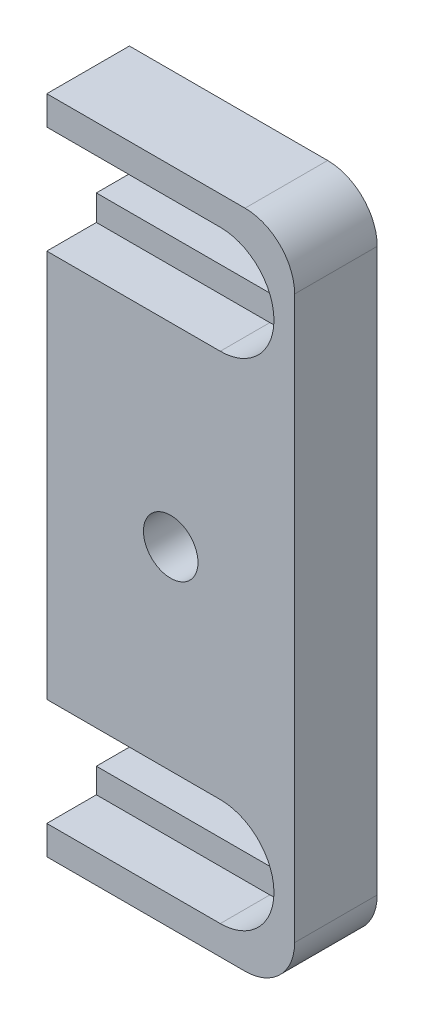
ISO-10303-21;
HEADER;
FILE_DESCRIPTION(('STEP AP214'),'2;1');
FILE_NAME('part.step','',(''),(''),'','','');
FILE_SCHEMA(('AUTOMOTIVE_DESIGN { 1 0 10303 214 1 1 1 1 }'));
ENDSEC;
DATA;
#1=APPLICATION_CONTEXT('core data for automotive mechanical design processes');
#2=APPLICATION_PROTOCOL_DEFINITION('international standard','automotive_design',2000,#1);
#3=PRODUCT_CONTEXT('',#1,'mechanical');
#4=PRODUCT('Part','Part','',(#3));
#5=PRODUCT_RELATED_PRODUCT_CATEGORY('part','',(#4));
#6=PRODUCT_DEFINITION_FORMATION('','',#4);
#7=PRODUCT_DEFINITION_CONTEXT('part definition',#1,'design');
#8=PRODUCT_DEFINITION('design','',#6,#7);
#9=PRODUCT_DEFINITION_SHAPE('','',#8);
#10=(LENGTH_UNIT() NAMED_UNIT(*) SI_UNIT(.MILLI.,.METRE.));
#11=(NAMED_UNIT(*) PLANE_ANGLE_UNIT() SI_UNIT($,.RADIAN.));
#12=(NAMED_UNIT(*) SI_UNIT($,.STERADIAN.) SOLID_ANGLE_UNIT());
#13=UNCERTAINTY_MEASURE_WITH_UNIT(LENGTH_MEASURE(1.E-05),#10,'distance_accuracy_value','');
#14=(GEOMETRIC_REPRESENTATION_CONTEXT(3) GLOBAL_UNCERTAINTY_ASSIGNED_CONTEXT((#13)) GLOBAL_UNIT_ASSIGNED_CONTEXT((#10,
#11,#12)) REPRESENTATION_CONTEXT('',''));
#15=CARTESIAN_POINT('',(0.,0.,0.));
#16=DIRECTION('',(0.,0.,1.));
#17=DIRECTION('',(1.,0.,0.));
#18=AXIS2_PLACEMENT_3D('',#15,#16,#17);
#19=CARTESIAN_POINT('',(0.,0.,0.));
#20=DIRECTION('',(-1.,0.,0.));
#21=DIRECTION('',(0.,-1.,0.));
#22=AXIS2_PLACEMENT_3D('',#19,#20,#21);
#23=PLANE('',#22);
#24=DIRECTION('',(0.,0.,-1.));
#25=VECTOR('',#24,1.);
#26=CARTESIAN_POINT('',(0.,-36.7500000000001,5.));
#27=LINE('',#26,#25);
#28=CARTESIAN_POINT('',(0.,-36.7500000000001,2.));
#29=VERTEX_POINT('',#28);
#30=CARTESIAN_POINT('',(0.,-36.7500000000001,0.));
#31=VERTEX_POINT('',#30);
#32=EDGE_CURVE('E184',#29,#31,#27,.T.);
#33=ORIENTED_EDGE('',*,*,#32,.T.);
#34=DIRECTION('',(0.,-1.,0.));
#35=VECTOR('',#34,1.);
#36=CARTESIAN_POINT('',(0.,0.,0.));
#37=LINE('',#36,#35);
#38=CARTESIAN_POINT('',(0.,-40.,0.));
#39=VERTEX_POINT('',#38);
#40=EDGE_CURVE('E197',#31,#39,#37,.T.);
#41=ORIENTED_EDGE('',*,*,#40,.T.);
#42=DIRECTION('',(0.,0.,1.));
#43=VECTOR('',#42,1.);
#44=CARTESIAN_POINT('',(0.,-40.,0.));
#45=LINE('',#44,#43);
#46=CARTESIAN_POINT('',(0.,-40.,5.));
#47=VERTEX_POINT('',#46);
#48=EDGE_CURVE('E226',#39,#47,#45,.T.);
#49=ORIENTED_EDGE('',*,*,#48,.T.);
#50=DIRECTION('',(0.,-1.,0.));
#51=VECTOR('',#50,1.);
#52=CARTESIAN_POINT('',(0.,0.,5.));
#53=LINE('',#52,#51);
#54=CARTESIAN_POINT('',(0.,-38.25,5.));
#55=VERTEX_POINT('',#54);
#56=EDGE_CURVE('E235',#55,#47,#53,.T.);
#57=ORIENTED_EDGE('',*,*,#56,.F.);
#58=DIRECTION('',(0.,0.,1.));
#59=VECTOR('',#58,1.);
#60=CARTESIAN_POINT('',(0.,-38.25,2.));
#61=LINE('',#60,#59);
#62=CARTESIAN_POINT('',(0.,-38.25,2.));
#63=VERTEX_POINT('',#62);
#64=EDGE_CURVE('E309',#63,#55,#61,.T.);
#65=ORIENTED_EDGE('',*,*,#64,.F.);
#66=DIRECTION('',(0.,-1.,0.));
#67=VECTOR('',#66,1.);
#68=CARTESIAN_POINT('',(0.,-31.7500000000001,2.));
#69=LINE('',#68,#67);
#70=EDGE_CURVE('E200',#29,#63,#69,.T.);
#71=ORIENTED_EDGE('',*,*,#70,.F.);
#72=EDGE_LOOP('',(#33,#41,#49,#57,#65,#71));
#73=FACE_BOUND('',#72,.T.);
#74=ADVANCED_FACE('F33',(#73),#23,.T.);
#75=DIRECTION('',(0.,0.,1.));
#76=VECTOR('',#75,1.);
#77=CARTESIAN_POINT('',(0.,-3.3,0.));
#78=LINE('',#77,#76);
#79=CARTESIAN_POINT('',(0.,-3.3,0.));
#80=VERTEX_POINT('',#79);
#81=CARTESIAN_POINT('',(0.,-3.3,2.));
#82=VERTEX_POINT('',#81);
#83=EDGE_CURVE('E321',#80,#82,#78,.T.);
#84=ORIENTED_EDGE('',*,*,#83,.T.);
#85=DIRECTION('',(0.,-1.,0.));
#86=VECTOR('',#85,1.);
#87=CARTESIAN_POINT('',(0.,-1.75,2.));
#88=LINE('',#87,#86);
#89=CARTESIAN_POINT('',(0.,-1.75,2.));
#90=VERTEX_POINT('',#89);
#91=EDGE_CURVE('E334',#90,#82,#88,.T.);
#92=ORIENTED_EDGE('',*,*,#91,.F.);
#93=DIRECTION('',(0.,0.,1.));
#94=VECTOR('',#93,1.);
#95=CARTESIAN_POINT('',(0.,-1.75,2.));
#96=LINE('',#95,#94);
#97=CARTESIAN_POINT('',(0.,-1.75,5.));
#98=VERTEX_POINT('',#97);
#99=EDGE_CURVE('E233',#90,#98,#96,.T.);
#100=ORIENTED_EDGE('',*,*,#99,.T.);
#101=CARTESIAN_POINT('',(0.,0.,5.));
#102=VERTEX_POINT('',#101);
#103=EDGE_CURVE('E236',#102,#98,#53,.T.);
#104=ORIENTED_EDGE('',*,*,#103,.F.);
#105=DIRECTION('',(0.,0.,1.));
#106=VECTOR('',#105,1.);
#107=CARTESIAN_POINT('',(0.,0.,0.));
#108=LINE('',#107,#106);
#109=CARTESIAN_POINT('',(0.,0.,0.));
#110=VERTEX_POINT('',#109);
#111=EDGE_CURVE('E221',#110,#102,#108,.T.);
#112=ORIENTED_EDGE('',*,*,#111,.F.);
#113=EDGE_CURVE('E211',#110,#80,#37,.T.);
#114=ORIENTED_EDGE('',*,*,#113,.T.);
#115=EDGE_LOOP('',(#84,#92,#100,#104,#112,#114));
#116=FACE_BOUND('',#115,.T.);
#117=ADVANCED_FACE('F366',(#116),#23,.T.);
#118=CARTESIAN_POINT('',(15.,-40.,0.));
#119=DIRECTION('',(1.,0.,0.));
#120=DIRECTION('',(0.,0.,-1.));
#121=AXIS2_PLACEMENT_3D('',#118,#119,#120);
#122=PLANE('',#121);
#123=DIRECTION('',(0.,1.,0.));
#124=VECTOR('',#123,1.);
#125=CARTESIAN_POINT('',(15.,-40.,5.));
#126=LINE('',#125,#124);
#127=CARTESIAN_POINT('',(15.,-37.,5.));
#128=VERTEX_POINT('',#127);
#129=CARTESIAN_POINT('',(15.,-3.,5.));
#130=VERTEX_POINT('',#129);
#131=EDGE_CURVE('E229',#128,#130,#126,.T.);
#132=ORIENTED_EDGE('',*,*,#131,.F.);
#133=DIRECTION('',(0.,0.,1.));
#134=VECTOR('',#133,1.);
#135=CARTESIAN_POINT('',(15.,-37.,0.));
#136=LINE('',#135,#134);
#137=CARTESIAN_POINT('',(15.,-37.,0.));
#138=VERTEX_POINT('',#137);
#139=EDGE_CURVE('E260',#128,#138,#136,.F.);
#140=ORIENTED_EDGE('',*,*,#139,.T.);
#141=DIRECTION('',(0.,1.,0.));
#142=VECTOR('',#141,1.);
#143=CARTESIAN_POINT('',(15.,-40.,0.));
#144=LINE('',#143,#142);
#145=CARTESIAN_POINT('',(15.,-3.,0.));
#146=VERTEX_POINT('',#145);
#147=EDGE_CURVE('E213',#138,#146,#144,.T.);
#148=ORIENTED_EDGE('',*,*,#147,.T.);
#149=DIRECTION('',(0.,0.,1.));
#150=VECTOR('',#149,1.);
#151=CARTESIAN_POINT('',(15.,-3.,0.));
#152=LINE('',#151,#150);
#153=EDGE_CURVE('E257',#146,#130,#152,.T.);
#154=ORIENTED_EDGE('',*,*,#153,.T.);
#155=EDGE_LOOP('',(#132,#140,#148,#154));
#156=FACE_BOUND('',#155,.T.);
#157=ADVANCED_FACE('F362',(#156),#122,.T.);
#158=CARTESIAN_POINT('',(0.,-40.,0.));
#159=DIRECTION('',(0.,-1.,0.));
#160=DIRECTION('',(1.,0.,0.));
#161=AXIS2_PLACEMENT_3D('',#158,#159,#160);
#162=PLANE('',#161);
#163=DIRECTION('',(1.,0.,0.));
#164=VECTOR('',#163,1.);
#165=CARTESIAN_POINT('',(0.,-40.,0.));
#166=LINE('',#165,#164);
#167=CARTESIAN_POINT('',(12.,-40.,0.));
#168=VERTEX_POINT('',#167);
#169=EDGE_CURVE('E207',#39,#168,#166,.T.);
#170=ORIENTED_EDGE('',*,*,#169,.T.);
#171=DIRECTION('',(0.,0.,1.));
#172=VECTOR('',#171,1.);
#173=CARTESIAN_POINT('',(12.,-40.,0.));
#174=LINE('',#173,#172);
#175=CARTESIAN_POINT('',(12.,-40.,5.));
#176=VERTEX_POINT('',#175);
#177=EDGE_CURVE('E251',#168,#176,#174,.T.);
#178=ORIENTED_EDGE('',*,*,#177,.T.);
#179=DIRECTION('',(1.,0.,0.));
#180=VECTOR('',#179,1.);
#181=CARTESIAN_POINT('',(0.,-40.,5.));
#182=LINE('',#181,#180);
#183=EDGE_CURVE('E239',#47,#176,#182,.T.);
#184=ORIENTED_EDGE('',*,*,#183,.F.);
#185=ORIENTED_EDGE('',*,*,#48,.F.);
#186=EDGE_LOOP('',(#170,#178,#184,#185));
#187=FACE_BOUND('',#186,.T.);
#188=ADVANCED_FACE('F267',(#187),#162,.T.);
#189=DIRECTION('',(0.,0.,-1.));
#190=VECTOR('',#189,1.);
#191=CARTESIAN_POINT('',(0.,-33.25,5.));
#192=LINE('',#191,#190);
#193=CARTESIAN_POINT('',(0.,-33.25,2.));
#194=VERTEX_POINT('',#193);
#195=CARTESIAN_POINT('',(0.,-33.25,0.));
#196=VERTEX_POINT('',#195);
#197=EDGE_CURVE('E201',#194,#196,#192,.T.);
#198=ORIENTED_EDGE('',*,*,#197,.F.);
#199=CARTESIAN_POINT('',(0.,-31.7500000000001,2.));
#200=VERTEX_POINT('',#199);
#201=EDGE_CURVE('E294',#200,#194,#69,.T.);
#202=ORIENTED_EDGE('',*,*,#201,.F.);
#203=DIRECTION('',(0.,0.,1.));
#204=VECTOR('',#203,1.);
#205=CARTESIAN_POINT('',(0.,-31.7500000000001,2.));
#206=LINE('',#205,#204);
#207=CARTESIAN_POINT('',(0.,-31.7500000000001,5.));
#208=VERTEX_POINT('',#207);
#209=EDGE_CURVE('E292',#200,#208,#206,.T.);
#210=ORIENTED_EDGE('',*,*,#209,.T.);
#211=CARTESIAN_POINT('',(0.,-8.25,5.));
#212=VERTEX_POINT('',#211);
#213=EDGE_CURVE('E240',#212,#208,#53,.T.);
#214=ORIENTED_EDGE('',*,*,#213,.F.);
#215=DIRECTION('',(0.,0.,1.));
#216=VECTOR('',#215,1.);
#217=CARTESIAN_POINT('',(0.,-8.25,2.));
#218=LINE('',#217,#216);
#219=CARTESIAN_POINT('',(0.,-8.25,2.));
#220=VERTEX_POINT('',#219);
#221=EDGE_CURVE('E290',#220,#212,#218,.T.);
#222=ORIENTED_EDGE('',*,*,#221,.F.);
#223=CARTESIAN_POINT('',(0.,-6.7,2.));
#224=VERTEX_POINT('',#223);
#225=EDGE_CURVE('E338',#224,#220,#88,.T.);
#226=ORIENTED_EDGE('',*,*,#225,.F.);
#227=DIRECTION('',(0.,0.,1.));
#228=VECTOR('',#227,1.);
#229=CARTESIAN_POINT('',(0.,-6.7,0.));
#230=LINE('',#229,#228);
#231=CARTESIAN_POINT('',(0.,-6.7,0.));
#232=VERTEX_POINT('',#231);
#233=EDGE_CURVE('E331',#232,#224,#230,.T.);
#234=ORIENTED_EDGE('',*,*,#233,.F.);
#235=EDGE_CURVE('E208',#232,#196,#37,.T.);
#236=ORIENTED_EDGE('',*,*,#235,.T.);
#237=EDGE_LOOP('',(#198,#202,#210,#214,#222,#226,#234,#236));
#238=FACE_BOUND('',#237,.T.);
#239=ADVANCED_FACE('F288',(#238),#23,.T.);
#240=CARTESIAN_POINT('',(15.,0.,0.));
#241=DIRECTION('',(0.,1.,0.));
#242=DIRECTION('',(0.,0.,1.));
#243=AXIS2_PLACEMENT_3D('',#240,#241,#242);
#244=PLANE('',#243);
#245=DIRECTION('',(-1.,0.,0.));
#246=VECTOR('',#245,1.);
#247=CARTESIAN_POINT('',(15.,0.,5.));
#248=LINE('',#247,#246);
#249=CARTESIAN_POINT('',(12.,0.,5.));
#250=VERTEX_POINT('',#249);
#251=EDGE_CURVE('E232',#250,#102,#248,.T.);
#252=ORIENTED_EDGE('',*,*,#251,.F.);
#253=DIRECTION('',(0.,0.,1.));
#254=VECTOR('',#253,1.);
#255=CARTESIAN_POINT('',(12.,0.,0.));
#256=LINE('',#255,#254);
#257=CARTESIAN_POINT('',(12.,0.,0.));
#258=VERTEX_POINT('',#257);
#259=EDGE_CURVE('E11',#250,#258,#256,.F.);
#260=ORIENTED_EDGE('',*,*,#259,.T.);
#261=DIRECTION('',(-1.,0.,0.));
#262=VECTOR('',#261,1.);
#263=CARTESIAN_POINT('',(15.,0.,0.));
#264=LINE('',#263,#262);
#265=EDGE_CURVE('E209',#258,#110,#264,.T.);
#266=ORIENTED_EDGE('',*,*,#265,.T.);
#267=ORIENTED_EDGE('',*,*,#111,.T.);
#268=EDGE_LOOP('',(#252,#260,#266,#267));
#269=FACE_BOUND('',#268,.T.);
#270=ADVANCED_FACE('F364',(#269),#244,.T.);
#271=CARTESIAN_POINT('',(0.,0.,0.));
#272=DIRECTION('',(0.,0.,1.));
#273=DIRECTION('',(1.,0.,0.));
#274=AXIS2_PLACEMENT_3D('',#271,#272,#273);
#275=PLANE('',#274);
#276=CARTESIAN_POINT('',(7.50000000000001,-20.,0.));
#277=DIRECTION('',(0.,0.,1.));
#278=DIRECTION('',(1.,0.,0.));
#279=AXIS2_PLACEMENT_3D('',#276,#277,#278);
#280=CIRCLE('',#279,1.65);
#281=CARTESIAN_POINT('',(9.15000000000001,-20.,0.));
#282=VERTEX_POINT('',#281);
#283=EDGE_CURVE('E192',#282,#282,#280,.T.);
#284=ORIENTED_EDGE('',*,*,#283,.T.);
#285=EDGE_LOOP('',(#284));
#286=FACE_BOUND('',#285,.T.);
#287=ORIENTED_EDGE('',*,*,#147,.F.);
#288=CARTESIAN_POINT('',(12.,-37.,0.));
#289=DIRECTION('',(0.,0.,1.));
#290=DIRECTION('',(1.,0.,0.));
#291=AXIS2_PLACEMENT_3D('',#288,#289,#290);
#292=CIRCLE('',#291,3.);
#293=EDGE_CURVE('E41',#138,#168,#292,.F.);
#294=ORIENTED_EDGE('',*,*,#293,.T.);
#295=ORIENTED_EDGE('',*,*,#169,.F.);
#296=ORIENTED_EDGE('',*,*,#40,.F.);
#297=DIRECTION('',(-1.,0.,0.));
#298=VECTOR('',#297,1.);
#299=CARTESIAN_POINT('',(10.5,-36.7500000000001,0.));
#300=LINE('',#299,#298);
#301=CARTESIAN_POINT('',(10.5,-36.7500000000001,0.));
#302=VERTEX_POINT('',#301);
#303=EDGE_CURVE('E181',#302,#31,#300,.T.);
#304=ORIENTED_EDGE('',*,*,#303,.F.);
#305=CARTESIAN_POINT('',(10.5,-35.,0.));
#306=DIRECTION('',(0.,0.,-1.));
#307=DIRECTION('',(-1.,0.,0.));
#308=AXIS2_PLACEMENT_3D('',#305,#306,#307);
#309=CIRCLE('',#308,1.75000000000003);
#310=CARTESIAN_POINT('',(10.5,-33.25,0.));
#311=VERTEX_POINT('',#310);
#312=EDGE_CURVE('E202',#311,#302,#309,.T.);
#313=ORIENTED_EDGE('',*,*,#312,.F.);
#314=DIRECTION('',(1.,0.,0.));
#315=VECTOR('',#314,1.);
#316=CARTESIAN_POINT('',(0.,-33.25,0.));
#317=LINE('',#316,#315);
#318=EDGE_CURVE('E191',#196,#311,#317,.T.);
#319=ORIENTED_EDGE('',*,*,#318,.F.);
#320=ORIENTED_EDGE('',*,*,#235,.F.);
#321=DIRECTION('',(1.,0.,0.));
#322=VECTOR('',#321,1.);
#323=CARTESIAN_POINT('',(0.,-6.7,0.));
#324=LINE('',#323,#322);
#325=CARTESIAN_POINT('',(10.5,-6.7,0.));
#326=VERTEX_POINT('',#325);
#327=EDGE_CURVE('E315',#232,#326,#324,.T.);
#328=ORIENTED_EDGE('',*,*,#327,.T.);
#329=CARTESIAN_POINT('',(10.5,-5.,0.));
#330=DIRECTION('',(0.,0.,1.));
#331=DIRECTION('',(1.,0.,0.));
#332=AXIS2_PLACEMENT_3D('',#329,#330,#331);
#333=CIRCLE('',#332,1.7);
#334=CARTESIAN_POINT('',(10.5,-3.30000000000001,0.));
#335=VERTEX_POINT('',#334);
#336=EDGE_CURVE('E319',#326,#335,#333,.T.);
#337=ORIENTED_EDGE('',*,*,#336,.T.);
#338=DIRECTION('',(-1.,0.,0.));
#339=VECTOR('',#338,1.);
#340=CARTESIAN_POINT('',(10.5,-3.3,0.));
#341=LINE('',#340,#339);
#342=EDGE_CURVE('E312',#335,#80,#341,.T.);
#343=ORIENTED_EDGE('',*,*,#342,.T.);
#344=ORIENTED_EDGE('',*,*,#113,.F.);
#345=ORIENTED_EDGE('',*,*,#265,.F.);
#346=CARTESIAN_POINT('',(12.,-3.,0.));
#347=DIRECTION('',(0.,0.,1.));
#348=DIRECTION('',(1.,0.,0.));
#349=AXIS2_PLACEMENT_3D('',#346,#347,#348);
#350=CIRCLE('',#349,3.);
#351=EDGE_CURVE('E53',#258,#146,#350,.F.);
#352=ORIENTED_EDGE('',*,*,#351,.T.);
#353=EDGE_LOOP('',(#287,#294,#295,#296,#304,#313,#319,#320,#328,#337,#343,#344,#345,#352));
#354=FACE_BOUND('',#353,.T.);
#355=ADVANCED_FACE('F205',(#286,#354),#275,.F.);
#356=CARTESIAN_POINT('',(0.,0.,5.));
#357=DIRECTION('',(0.,0.,1.));
#358=DIRECTION('',(1.,0.,0.));
#359=AXIS2_PLACEMENT_3D('',#356,#357,#358);
#360=PLANE('',#359);
#361=CARTESIAN_POINT('',(7.50000000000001,-20.,5.));
#362=DIRECTION('',(0.,0.,1.));
#363=DIRECTION('',(1.,0.,0.));
#364=AXIS2_PLACEMENT_3D('',#361,#362,#363);
#365=CIRCLE('',#364,1.65);
#366=CARTESIAN_POINT('',(9.15000000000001,-20.,5.));
#367=VERTEX_POINT('',#366);
#368=EDGE_CURVE('E493',#367,#367,#365,.T.);
#369=ORIENTED_EDGE('',*,*,#368,.F.);
#370=EDGE_LOOP('',(#369));
#371=FACE_BOUND('',#370,.T.);
#372=ORIENTED_EDGE('',*,*,#183,.T.);
#373=CARTESIAN_POINT('',(12.,-37.,5.));
#374=DIRECTION('',(0.,0.,1.));
#375=DIRECTION('',(1.,0.,0.));
#376=AXIS2_PLACEMENT_3D('',#373,#374,#375);
#377=CIRCLE('',#376,3.);
#378=EDGE_CURVE('E255',#176,#128,#377,.T.);
#379=ORIENTED_EDGE('',*,*,#378,.T.);
#380=ORIENTED_EDGE('',*,*,#131,.T.);
#381=CARTESIAN_POINT('',(12.,-3.,5.));
#382=DIRECTION('',(0.,0.,1.));
#383=DIRECTION('',(1.,0.,0.));
#384=AXIS2_PLACEMENT_3D('',#381,#382,#383);
#385=CIRCLE('',#384,3.);
#386=EDGE_CURVE('E253',#130,#250,#385,.T.);
#387=ORIENTED_EDGE('',*,*,#386,.T.);
#388=ORIENTED_EDGE('',*,*,#251,.T.);
#389=ORIENTED_EDGE('',*,*,#103,.T.);
#390=DIRECTION('',(-1.,0.,0.));
#391=VECTOR('',#390,1.);
#392=CARTESIAN_POINT('',(10.5,-1.75,5.));
#393=LINE('',#392,#391);
#394=CARTESIAN_POINT('',(10.5,-1.75000000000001,5.));
#395=VERTEX_POINT('',#394);
#396=EDGE_CURVE('E351',#395,#98,#393,.T.);
#397=ORIENTED_EDGE('',*,*,#396,.F.);
#398=CARTESIAN_POINT('',(10.5,-5.,5.));
#399=DIRECTION('',(0.,0.,1.));
#400=DIRECTION('',(1.,0.,0.));
#401=AXIS2_PLACEMENT_3D('',#398,#399,#400);
#402=CIRCLE('',#401,3.25);
#403=CARTESIAN_POINT('',(10.5,-8.25,5.));
#404=VERTEX_POINT('',#403);
#405=EDGE_CURVE('E348',#404,#395,#402,.T.);
#406=ORIENTED_EDGE('',*,*,#405,.F.);
#407=DIRECTION('',(1.,0.,0.));
#408=VECTOR('',#407,1.);
#409=CARTESIAN_POINT('',(0.,-8.25,5.));
#410=LINE('',#409,#408);
#411=EDGE_CURVE('E283',#212,#404,#410,.T.);
#412=ORIENTED_EDGE('',*,*,#411,.F.);
#413=ORIENTED_EDGE('',*,*,#213,.T.);
#414=DIRECTION('',(-1.,0.,0.));
#415=VECTOR('',#414,1.);
#416=CARTESIAN_POINT('',(10.5,-31.7500000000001,5.));
#417=LINE('',#416,#415);
#418=CARTESIAN_POINT('',(10.5,-31.7500000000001,5.));
#419=VERTEX_POINT('',#418);
#420=EDGE_CURVE('E280',#419,#208,#417,.T.);
#421=ORIENTED_EDGE('',*,*,#420,.F.);
#422=CARTESIAN_POINT('',(10.5,-35.,5.));
#423=DIRECTION('',(0.,0.,1.));
#424=DIRECTION('',(1.,0.,0.));
#425=AXIS2_PLACEMENT_3D('',#422,#423,#424);
#426=CIRCLE('',#425,3.24999999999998);
#427=CARTESIAN_POINT('',(10.5,-38.25,5.));
#428=VERTEX_POINT('',#427);
#429=EDGE_CURVE('E405',#428,#419,#426,.T.);
#430=ORIENTED_EDGE('',*,*,#429,.F.);
#431=DIRECTION('',(1.,0.,0.));
#432=VECTOR('',#431,1.);
#433=CARTESIAN_POINT('',(0.,-38.25,5.));
#434=LINE('',#433,#432);
#435=EDGE_CURVE('E275',#55,#428,#434,.T.);
#436=ORIENTED_EDGE('',*,*,#435,.F.);
#437=ORIENTED_EDGE('',*,*,#56,.T.);
#438=EDGE_LOOP('',(#372,#379,#380,#387,#388,#389,#397,#406,#412,#413,#421,#430,#436,#437));
#439=FACE_BOUND('',#438,.T.);
#440=ADVANCED_FACE('F269',(#371,#439),#360,.T.);
#441=CARTESIAN_POINT('',(10.5,-1.75,2.));
#442=DIRECTION('',(0.,1.,0.));
#443=DIRECTION('',(-1.,0.,0.));
#444=AXIS2_PLACEMENT_3D('',#441,#442,#443);
#445=PLANE('',#444);
#446=ORIENTED_EDGE('',*,*,#396,.T.);
#447=ORIENTED_EDGE('',*,*,#99,.F.);
#448=DIRECTION('',(-1.,0.,0.));
#449=VECTOR('',#448,1.);
#450=CARTESIAN_POINT('',(10.5,-1.75,2.));
#451=LINE('',#450,#449);
#452=CARTESIAN_POINT('',(10.5,-1.75000000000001,2.));
#453=VERTEX_POINT('',#452);
#454=EDGE_CURVE('E344',#453,#90,#451,.T.);
#455=ORIENTED_EDGE('',*,*,#454,.F.);
#456=DIRECTION('',(0.,0.,1.));
#457=VECTOR('',#456,1.);
#458=CARTESIAN_POINT('',(10.5,-1.75000000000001,2.));
#459=LINE('',#458,#457);
#460=EDGE_CURVE('E355',#453,#395,#459,.T.);
#461=ORIENTED_EDGE('',*,*,#460,.T.);
#462=EDGE_LOOP('',(#446,#447,#455,#461));
#463=FACE_BOUND('',#462,.T.);
#464=ADVANCED_FACE('F370',(#463),#445,.F.);
#465=CARTESIAN_POINT('',(10.5,-5.,2.));
#466=DIRECTION('',(0.,0.,1.));
#467=DIRECTION('',(1.,0.,0.));
#468=AXIS2_PLACEMENT_3D('',#465,#466,#467);
#469=CYLINDRICAL_SURFACE('',#468,3.25);
#470=ORIENTED_EDGE('',*,*,#405,.T.);
#471=ORIENTED_EDGE('',*,*,#460,.F.);
#472=CARTESIAN_POINT('',(10.5,-5.,2.));
#473=DIRECTION('',(0.,0.,1.));
#474=DIRECTION('',(1.,0.,0.));
#475=AXIS2_PLACEMENT_3D('',#472,#473,#474);
#476=CIRCLE('',#475,3.25);
#477=CARTESIAN_POINT('',(10.5,-8.25,2.));
#478=VERTEX_POINT('',#477);
#479=EDGE_CURVE('E341',#478,#453,#476,.T.);
#480=ORIENTED_EDGE('',*,*,#479,.F.);
#481=DIRECTION('',(0.,0.,1.));
#482=VECTOR('',#481,1.);
#483=CARTESIAN_POINT('',(10.5,-8.25,2.));
#484=LINE('',#483,#482);
#485=EDGE_CURVE('E357',#478,#404,#484,.T.);
#486=ORIENTED_EDGE('',*,*,#485,.T.);
#487=EDGE_LOOP('',(#470,#471,#480,#486));
#488=FACE_BOUND('',#487,.T.);
#489=ADVANCED_FACE('F374',(#488),#469,.F.);
#490=CARTESIAN_POINT('',(0.,-8.25,2.));
#491=DIRECTION('',(0.,-1.,0.));
#492=DIRECTION('',(0.,0.,-1.));
#493=AXIS2_PLACEMENT_3D('',#490,#491,#492);
#494=PLANE('',#493);
#495=ORIENTED_EDGE('',*,*,#411,.T.);
#496=ORIENTED_EDGE('',*,*,#485,.F.);
#497=DIRECTION('',(1.,0.,0.));
#498=VECTOR('',#497,1.);
#499=CARTESIAN_POINT('',(0.,-8.25,2.));
#500=LINE('',#499,#498);
#501=EDGE_CURVE('E337',#220,#478,#500,.T.);
#502=ORIENTED_EDGE('',*,*,#501,.F.);
#503=ORIENTED_EDGE('',*,*,#221,.T.);
#504=EDGE_LOOP('',(#495,#496,#502,#503));
#505=FACE_BOUND('',#504,.T.);
#506=ADVANCED_FACE('F377',(#505),#494,.F.);
#507=CARTESIAN_POINT('',(10.5,-5.,2.));
#508=DIRECTION('',(0.,0.,1.));
#509=DIRECTION('',(1.,0.,0.));
#510=AXIS2_PLACEMENT_3D('',#507,#508,#509);
#511=PLANE('',#510);
#512=DIRECTION('',(-1.,0.,0.));
#513=VECTOR('',#512,1.);
#514=CARTESIAN_POINT('',(10.5,-3.3,2.));
#515=LINE('',#514,#513);
#516=CARTESIAN_POINT('',(10.5,-3.30000000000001,2.));
#517=VERTEX_POINT('',#516);
#518=EDGE_CURVE('E298',#517,#82,#515,.T.);
#519=ORIENTED_EDGE('',*,*,#518,.F.);
#520=CARTESIAN_POINT('',(10.5,-5.,2.));
#521=DIRECTION('',(0.,0.,1.));
#522=DIRECTION('',(1.,0.,0.));
#523=AXIS2_PLACEMENT_3D('',#520,#521,#522);
#524=CIRCLE('',#523,1.7);
#525=CARTESIAN_POINT('',(10.5,-6.7,2.));
#526=VERTEX_POINT('',#525);
#527=EDGE_CURVE('E316',#526,#517,#524,.T.);
#528=ORIENTED_EDGE('',*,*,#527,.F.);
#529=DIRECTION('',(1.,0.,0.));
#530=VECTOR('',#529,1.);
#531=CARTESIAN_POINT('',(0.,-6.7,2.));
#532=LINE('',#531,#530);
#533=EDGE_CURVE('E301',#224,#526,#532,.T.);
#534=ORIENTED_EDGE('',*,*,#533,.F.);
#535=ORIENTED_EDGE('',*,*,#225,.T.);
#536=ORIENTED_EDGE('',*,*,#501,.T.);
#537=ORIENTED_EDGE('',*,*,#479,.T.);
#538=ORIENTED_EDGE('',*,*,#454,.T.);
#539=ORIENTED_EDGE('',*,*,#91,.T.);
#540=EDGE_LOOP('',(#519,#528,#534,#535,#536,#537,#538,#539));
#541=FACE_BOUND('',#540,.T.);
#542=ADVANCED_FACE('F380',(#541),#511,.T.);
#543=CARTESIAN_POINT('',(10.5,-3.3,0.));
#544=DIRECTION('',(0.,1.,0.));
#545=DIRECTION('',(-1.,0.,0.));
#546=AXIS2_PLACEMENT_3D('',#543,#544,#545);
#547=PLANE('',#546);
#548=ORIENTED_EDGE('',*,*,#518,.T.);
#549=ORIENTED_EDGE('',*,*,#83,.F.);
#550=ORIENTED_EDGE('',*,*,#342,.F.);
#551=DIRECTION('',(0.,0.,1.));
#552=VECTOR('',#551,1.);
#553=CARTESIAN_POINT('',(10.5,-3.30000000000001,0.));
#554=LINE('',#553,#552);
#555=EDGE_CURVE('E327',#335,#517,#554,.T.);
#556=ORIENTED_EDGE('',*,*,#555,.T.);
#557=EDGE_LOOP('',(#548,#549,#550,#556));
#558=FACE_BOUND('',#557,.T.);
#559=ADVANCED_FACE('F459',(#558),#547,.F.);
#560=CARTESIAN_POINT('',(10.5,-5.,0.));
#561=DIRECTION('',(0.,0.,1.));
#562=DIRECTION('',(1.,0.,0.));
#563=AXIS2_PLACEMENT_3D('',#560,#561,#562);
#564=CYLINDRICAL_SURFACE('',#563,1.7);
#565=ORIENTED_EDGE('',*,*,#527,.T.);
#566=ORIENTED_EDGE('',*,*,#555,.F.);
#567=ORIENTED_EDGE('',*,*,#336,.F.);
#568=DIRECTION('',(0.,0.,1.));
#569=VECTOR('',#568,1.);
#570=CARTESIAN_POINT('',(10.5,-6.7,0.));
#571=LINE('',#570,#569);
#572=EDGE_CURVE('E329',#326,#526,#571,.T.);
#573=ORIENTED_EDGE('',*,*,#572,.T.);
#574=EDGE_LOOP('',(#565,#566,#567,#573));
#575=FACE_BOUND('',#574,.T.);
#576=ADVANCED_FACE('F425',(#575),#564,.F.);
#577=CARTESIAN_POINT('',(0.,-6.7,0.));
#578=DIRECTION('',(0.,-1.,0.));
#579=DIRECTION('',(1.,0.,0.));
#580=AXIS2_PLACEMENT_3D('',#577,#578,#579);
#581=PLANE('',#580);
#582=ORIENTED_EDGE('',*,*,#533,.T.);
#583=ORIENTED_EDGE('',*,*,#572,.F.);
#584=ORIENTED_EDGE('',*,*,#327,.F.);
#585=ORIENTED_EDGE('',*,*,#233,.T.);
#586=EDGE_LOOP('',(#582,#583,#584,#585));
#587=FACE_BOUND('',#586,.T.);
#588=ADVANCED_FACE('F418',(#587),#581,.F.);
#589=CARTESIAN_POINT('',(10.5,-31.7500000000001,2.));
#590=DIRECTION('',(0.,1.,0.));
#591=DIRECTION('',(0.,0.,1.));
#592=AXIS2_PLACEMENT_3D('',#589,#590,#591);
#593=PLANE('',#592);
#594=ORIENTED_EDGE('',*,*,#420,.T.);
#595=ORIENTED_EDGE('',*,*,#209,.F.);
#596=DIRECTION('',(-1.,0.,0.));
#597=VECTOR('',#596,1.);
#598=CARTESIAN_POINT('',(10.5,-31.7500000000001,2.));
#599=LINE('',#598,#597);
#600=CARTESIAN_POINT('',(10.5,-31.7500000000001,2.));
#601=VERTEX_POINT('',#600);
#602=EDGE_CURVE('E311',#601,#200,#599,.T.);
#603=ORIENTED_EDGE('',*,*,#602,.F.);
#604=DIRECTION('',(0.,0.,1.));
#605=VECTOR('',#604,1.);
#606=CARTESIAN_POINT('',(10.5,-31.7500000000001,2.));
#607=LINE('',#606,#605);
#608=EDGE_CURVE('E299',#601,#419,#607,.T.);
#609=ORIENTED_EDGE('',*,*,#608,.T.);
#610=EDGE_LOOP('',(#594,#595,#603,#609));
#611=FACE_BOUND('',#610,.T.);
#612=ADVANCED_FACE('F416',(#611),#593,.F.);
#613=CARTESIAN_POINT('',(10.5,-35.,2.));
#614=DIRECTION('',(0.,0.,1.));
#615=DIRECTION('',(1.,0.,0.));
#616=AXIS2_PLACEMENT_3D('',#613,#614,#615);
#617=CYLINDRICAL_SURFACE('',#616,3.24999999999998);
#618=ORIENTED_EDGE('',*,*,#429,.T.);
#619=ORIENTED_EDGE('',*,*,#608,.F.);
#620=CARTESIAN_POINT('',(10.5,-35.,2.));
#621=DIRECTION('',(0.,0.,1.));
#622=DIRECTION('',(1.,0.,0.));
#623=AXIS2_PLACEMENT_3D('',#620,#621,#622);
#624=CIRCLE('',#623,3.24999999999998);
#625=CARTESIAN_POINT('',(10.5,-38.25,2.));
#626=VERTEX_POINT('',#625);
#627=EDGE_CURVE('E401',#626,#601,#624,.T.);
#628=ORIENTED_EDGE('',*,*,#627,.F.);
#629=DIRECTION('',(0.,0.,1.));
#630=VECTOR('',#629,1.);
#631=CARTESIAN_POINT('',(10.5,-38.25,2.));
#632=LINE('',#631,#630);
#633=EDGE_CURVE('E303',#626,#428,#632,.T.);
#634=ORIENTED_EDGE('',*,*,#633,.T.);
#635=EDGE_LOOP('',(#618,#619,#628,#634));
#636=FACE_BOUND('',#635,.T.);
#637=ADVANCED_FACE('F415',(#636),#617,.F.);
#638=CARTESIAN_POINT('',(0.,-38.25,2.));
#639=DIRECTION('',(0.,-1.,0.));
#640=DIRECTION('',(0.,0.,-1.));
#641=AXIS2_PLACEMENT_3D('',#638,#639,#640);
#642=PLANE('',#641);
#643=ORIENTED_EDGE('',*,*,#435,.T.);
#644=ORIENTED_EDGE('',*,*,#633,.F.);
#645=DIRECTION('',(1.,0.,0.));
#646=VECTOR('',#645,1.);
#647=CARTESIAN_POINT('',(0.,-38.25,2.));
#648=LINE('',#647,#646);
#649=EDGE_CURVE('E398',#63,#626,#648,.T.);
#650=ORIENTED_EDGE('',*,*,#649,.F.);
#651=ORIENTED_EDGE('',*,*,#64,.T.);
#652=EDGE_LOOP('',(#643,#644,#650,#651));
#653=FACE_BOUND('',#652,.T.);
#654=ADVANCED_FACE('F413',(#653),#642,.F.);
#655=CARTESIAN_POINT('',(10.5,-35.,2.));
#656=DIRECTION('',(0.,0.,1.));
#657=DIRECTION('',(1.,0.,0.));
#658=AXIS2_PLACEMENT_3D('',#655,#656,#657);
#659=PLANE('',#658);
#660=DIRECTION('',(1.,0.,0.));
#661=VECTOR('',#660,1.);
#662=CARTESIAN_POINT('',(10.5,-36.7500000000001,2.));
#663=LINE('',#662,#661);
#664=CARTESIAN_POINT('',(10.5,-36.7500000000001,2.));
#665=VERTEX_POINT('',#664);
#666=EDGE_CURVE('E249',#29,#665,#663,.T.);
#667=ORIENTED_EDGE('',*,*,#666,.F.);
#668=ORIENTED_EDGE('',*,*,#70,.T.);
#669=ORIENTED_EDGE('',*,*,#649,.T.);
#670=ORIENTED_EDGE('',*,*,#627,.T.);
#671=ORIENTED_EDGE('',*,*,#602,.T.);
#672=ORIENTED_EDGE('',*,*,#201,.T.);
#673=DIRECTION('',(-1.,0.,0.));
#674=VECTOR('',#673,1.);
#675=CARTESIAN_POINT('',(10.5,-33.25,2.));
#676=LINE('',#675,#674);
#677=CARTESIAN_POINT('',(10.5,-33.25,2.));
#678=VERTEX_POINT('',#677);
#679=EDGE_CURVE('E243',#678,#194,#676,.T.);
#680=ORIENTED_EDGE('',*,*,#679,.F.);
#681=CARTESIAN_POINT('',(10.5,-35.,2.));
#682=DIRECTION('',(0.,0.,1.));
#683=DIRECTION('',(1.,0.,0.));
#684=AXIS2_PLACEMENT_3D('',#681,#682,#683);
#685=CIRCLE('',#684,1.75000000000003);
#686=EDGE_CURVE('E246',#665,#678,#685,.T.);
#687=ORIENTED_EDGE('',*,*,#686,.F.);
#688=EDGE_LOOP('',(#667,#668,#669,#670,#671,#672,#680,#687));
#689=FACE_BOUND('',#688,.T.);
#690=ADVANCED_FACE('F410',(#689),#659,.T.);
#691=CARTESIAN_POINT('',(10.5,-36.7500000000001,5.));
#692=DIRECTION('',(0.,-1.,0.));
#693=DIRECTION('',(0.,0.,-1.));
#694=AXIS2_PLACEMENT_3D('',#691,#692,#693);
#695=PLANE('',#694);
#696=ORIENTED_EDGE('',*,*,#666,.T.);
#697=DIRECTION('',(0.,0.,-1.));
#698=VECTOR('',#697,1.);
#699=CARTESIAN_POINT('',(10.5,-36.7500000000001,5.));
#700=LINE('',#699,#698);
#701=EDGE_CURVE('E187',#665,#302,#700,.T.);
#702=ORIENTED_EDGE('',*,*,#701,.T.);
#703=ORIENTED_EDGE('',*,*,#303,.T.);
#704=ORIENTED_EDGE('',*,*,#32,.F.);
#705=EDGE_LOOP('',(#696,#702,#703,#704));
#706=FACE_BOUND('',#705,.T.);
#707=ADVANCED_FACE('F183',(#706),#695,.F.);
#708=CARTESIAN_POINT('',(10.5,-35.,5.));
#709=DIRECTION('',(0.,0.,-1.));
#710=DIRECTION('',(-1.,0.,0.));
#711=AXIS2_PLACEMENT_3D('',#708,#709,#710);
#712=CYLINDRICAL_SURFACE('',#711,1.75000000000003);
#713=ORIENTED_EDGE('',*,*,#686,.T.);
#714=DIRECTION('',(0.,0.,-1.));
#715=VECTOR('',#714,1.);
#716=CARTESIAN_POINT('',(10.5,-33.25,5.));
#717=LINE('',#716,#715);
#718=EDGE_CURVE('E394',#678,#311,#717,.T.);
#719=ORIENTED_EDGE('',*,*,#718,.T.);
#720=ORIENTED_EDGE('',*,*,#312,.T.);
#721=ORIENTED_EDGE('',*,*,#701,.F.);
#722=EDGE_LOOP('',(#713,#719,#720,#721));
#723=FACE_BOUND('',#722,.T.);
#724=ADVANCED_FACE('F473',(#723),#712,.F.);
#725=CARTESIAN_POINT('',(0.,-33.25,5.));
#726=DIRECTION('',(0.,1.,0.));
#727=DIRECTION('',(0.,0.,1.));
#728=AXIS2_PLACEMENT_3D('',#725,#726,#727);
#729=PLANE('',#728);
#730=ORIENTED_EDGE('',*,*,#679,.T.);
#731=ORIENTED_EDGE('',*,*,#197,.T.);
#732=ORIENTED_EDGE('',*,*,#318,.T.);
#733=ORIENTED_EDGE('',*,*,#718,.F.);
#734=EDGE_LOOP('',(#730,#731,#732,#733));
#735=FACE_BOUND('',#734,.T.);
#736=ADVANCED_FACE('F476',(#735),#729,.F.);
#737=CARTESIAN_POINT('',(7.50000000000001,-20.,5.));
#738=DIRECTION('',(0.,0.,1.));
#739=DIRECTION('',(1.,0.,0.));
#740=AXIS2_PLACEMENT_3D('',#737,#738,#739);
#741=CYLINDRICAL_SURFACE('',#740,1.65);
#742=ORIENTED_EDGE('',*,*,#283,.F.);
#743=EDGE_LOOP('',(#742));
#744=FACE_BOUND('',#743,.T.);
#745=ORIENTED_EDGE('',*,*,#368,.T.);
#746=EDGE_LOOP('',(#745));
#747=FACE_BOUND('',#746,.T.);
#748=ADVANCED_FACE('F479',(#744,#747),#741,.F.);
#749=CARTESIAN_POINT('',(12.,-37.,0.));
#750=DIRECTION('',(0.,0.,1.));
#751=DIRECTION('',(1.,0.,0.));
#752=AXIS2_PLACEMENT_3D('',#749,#750,#751);
#753=CYLINDRICAL_SURFACE('',#752,3.);
#754=ORIENTED_EDGE('',*,*,#293,.F.);
#755=ORIENTED_EDGE('',*,*,#139,.F.);
#756=ORIENTED_EDGE('',*,*,#378,.F.);
#757=ORIENTED_EDGE('',*,*,#177,.F.);
#758=EDGE_LOOP('',(#754,#755,#756,#757));
#759=FACE_BOUND('',#758,.T.);
#760=ADVANCED_FACE('F265',(#759),#753,.T.);
#761=CARTESIAN_POINT('',(12.,-3.,0.));
#762=DIRECTION('',(0.,0.,1.));
#763=DIRECTION('',(1.,0.,0.));
#764=AXIS2_PLACEMENT_3D('',#761,#762,#763);
#765=CYLINDRICAL_SURFACE('',#764,3.);
#766=ORIENTED_EDGE('',*,*,#351,.F.);
#767=ORIENTED_EDGE('',*,*,#259,.F.);
#768=ORIENTED_EDGE('',*,*,#386,.F.);
#769=ORIENTED_EDGE('',*,*,#153,.F.);
#770=EDGE_LOOP('',(#766,#767,#768,#769));
#771=FACE_BOUND('',#770,.T.);
#772=ADVANCED_FACE('F35',(#771),#765,.T.);
#773=CLOSED_SHELL('',(#74,#117,#157,#188,#239,#270,#355,#440,#464,#489,#506,#542,#559,#576,#588,
#612,#637,#654,#690,#707,#724,#736,#748,#760,#772));
#774=MANIFOLD_SOLID_BREP('B2',#773);
#775=ADVANCED_BREP_SHAPE_REPRESENTATION('',(#18,#774),#14);
#776=SHAPE_DEFINITION_REPRESENTATION(#9,#775);
ENDSEC;
END-ISO-10303-21;
